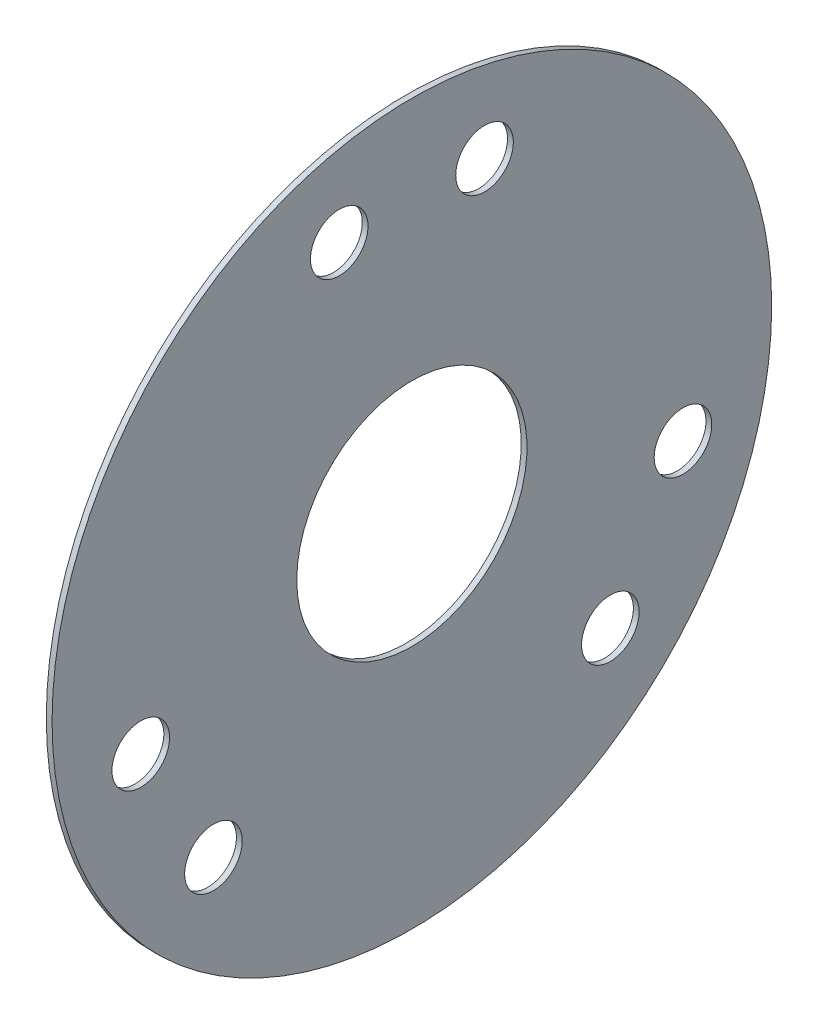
ISO-10303-21;
HEADER;
FILE_DESCRIPTION(('STEP AP214'),'2;1');
FILE_NAME('part.step','',(''),(''),'','','');
FILE_SCHEMA(('AUTOMOTIVE_DESIGN { 1 0 10303 214 1 1 1 1 }'));
ENDSEC;
DATA;
#1=APPLICATION_CONTEXT('core data for automotive mechanical design processes');
#2=APPLICATION_PROTOCOL_DEFINITION('international standard','automotive_design',2000,#1);
#3=PRODUCT_CONTEXT('',#1,'mechanical');
#4=PRODUCT('Part','Part','',(#3));
#5=PRODUCT_RELATED_PRODUCT_CATEGORY('part','',(#4));
#6=PRODUCT_DEFINITION_FORMATION('','',#4);
#7=PRODUCT_DEFINITION_CONTEXT('part definition',#1,'design');
#8=PRODUCT_DEFINITION('design','',#6,#7);
#9=PRODUCT_DEFINITION_SHAPE('','',#8);
#10=(LENGTH_UNIT() NAMED_UNIT(*) SI_UNIT(.MILLI.,.METRE.));
#11=(NAMED_UNIT(*) PLANE_ANGLE_UNIT() SI_UNIT($,.RADIAN.));
#12=(NAMED_UNIT(*) SI_UNIT($,.STERADIAN.) SOLID_ANGLE_UNIT());
#13=UNCERTAINTY_MEASURE_WITH_UNIT(LENGTH_MEASURE(1.E-05),#10,'distance_accuracy_value','');
#14=(GEOMETRIC_REPRESENTATION_CONTEXT(3) GLOBAL_UNCERTAINTY_ASSIGNED_CONTEXT((#13)) GLOBAL_UNIT_ASSIGNED_CONTEXT((#10,
#11,#12)) REPRESENTATION_CONTEXT('',''));
#15=CARTESIAN_POINT('',(0.,0.,0.));
#16=DIRECTION('',(0.,0.,1.));
#17=DIRECTION('',(1.,0.,0.));
#18=AXIS2_PLACEMENT_3D('',#15,#16,#17);
#19=CARTESIAN_POINT('',(-19.8,15.,15.));
#20=DIRECTION('',(1.,0.,0.));
#21=DIRECTION('',(0.,0.,-1.));
#22=AXIS2_PLACEMENT_3D('',#19,#20,#21);
#23=PLANE('',#22);
#24=CARTESIAN_POINT('',(-19.8,15.,15.));
#25=DIRECTION('',(1.,0.,0.));
#26=DIRECTION('',(0.,0.,-1.));
#27=AXIS2_PLACEMENT_3D('',#24,#25,#26);
#28=CIRCLE('',#27,12.5);
#29=CARTESIAN_POINT('',(-19.8,15.,2.5));
#30=VERTEX_POINT('',#29);
#31=EDGE_CURVE('E47',#30,#30,#28,.F.);
#32=ORIENTED_EDGE('',*,*,#31,.F.);
#33=EDGE_LOOP('',(#32));
#34=FACE_BOUND('',#33,.T.);
#35=CARTESIAN_POINT('',(-19.8,15.,15.));
#36=DIRECTION('',(-1.,0.,0.));
#37=DIRECTION('',(0.,0.,1.));
#38=AXIS2_PLACEMENT_3D('',#35,#36,#37);
#39=CIRCLE('',#38,4.);
#40=CARTESIAN_POINT('',(-19.8,15.,19.));
#41=VERTEX_POINT('',#40);
#42=EDGE_CURVE('E50',#41,#41,#39,.T.);
#43=ORIENTED_EDGE('',*,*,#42,.T.);
#44=EDGE_LOOP('',(#43));
#45=FACE_BOUND('',#44,.T.);
#46=CARTESIAN_POINT('',(-19.8,12.4765143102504,5.58222319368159));
#47=DIRECTION('',(-1.,0.,0.));
#48=DIRECTION('',(0.,0.,1.));
#49=AXIS2_PLACEMENT_3D('',#46,#47,#48);
#50=CIRCLE('',#49,1.);
#51=CARTESIAN_POINT('',(-19.8,12.4765143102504,6.58222319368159));
#52=VERTEX_POINT('',#51);
#53=EDGE_CURVE('E53',#52,#52,#50,.T.);
#54=ORIENTED_EDGE('',*,*,#53,.T.);
#55=EDGE_LOOP('',(#54));
#56=FACE_BOUND('',#55,.T.);
#57=CARTESIAN_POINT('',(-19.8,8.10570888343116,8.10570888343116));
#58=DIRECTION('',(-1.,0.,0.));
#59=DIRECTION('',(0.,0.,1.));
#60=AXIS2_PLACEMENT_3D('',#57,#58,#59);
#61=CIRCLE('',#60,1.);
#62=CARTESIAN_POINT('',(-19.8,8.10570888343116,9.10570888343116));
#63=VERTEX_POINT('',#62);
#64=EDGE_CURVE('E56',#63,#63,#61,.T.);
#65=ORIENTED_EDGE('',*,*,#64,.T.);
#66=EDGE_LOOP('',(#65));
#67=FACE_BOUND('',#66,.T.);
#68=CARTESIAN_POINT('',(-19.8,24.4177768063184,17.5234856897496));
#69=DIRECTION('',(-1.,0.,0.));
#70=DIRECTION('',(0.,0.,1.));
#71=AXIS2_PLACEMENT_3D('',#68,#69,#70);
#72=CIRCLE('',#71,1.);
#73=CARTESIAN_POINT('',(-19.8,24.4177768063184,18.5234856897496));
#74=VERTEX_POINT('',#73);
#75=EDGE_CURVE('E59',#74,#74,#72,.T.);
#76=ORIENTED_EDGE('',*,*,#75,.T.);
#77=EDGE_LOOP('',(#76));
#78=FACE_BOUND('',#77,.T.);
#79=CARTESIAN_POINT('',(-19.8,8.10570888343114,21.8942911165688));
#80=DIRECTION('',(-1.,0.,0.));
#81=DIRECTION('',(0.,0.,1.));
#82=AXIS2_PLACEMENT_3D('',#79,#80,#81);
#83=CIRCLE('',#82,1.);
#84=CARTESIAN_POINT('',(-19.8,8.10570888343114,22.8942911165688));
#85=VERTEX_POINT('',#84);
#86=EDGE_CURVE('E62',#85,#85,#83,.T.);
#87=ORIENTED_EDGE('',*,*,#86,.T.);
#88=EDGE_LOOP('',(#87));
#89=FACE_BOUND('',#88,.T.);
#90=CARTESIAN_POINT('',(-19.8,24.4177768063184,12.4765143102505));
#91=DIRECTION('',(-1.,0.,0.));
#92=DIRECTION('',(0.,0.,1.));
#93=AXIS2_PLACEMENT_3D('',#90,#91,#92);
#94=CIRCLE('',#93,1.);
#95=CARTESIAN_POINT('',(-19.8,24.4177768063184,13.4765143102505));
#96=VERTEX_POINT('',#95);
#97=EDGE_CURVE('E64',#96,#96,#94,.T.);
#98=ORIENTED_EDGE('',*,*,#97,.T.);
#99=EDGE_LOOP('',(#98));
#100=FACE_BOUND('',#99,.T.);
#101=CARTESIAN_POINT('',(-19.8,12.4765143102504,24.4177768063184));
#102=DIRECTION('',(-1.,0.,0.));
#103=DIRECTION('',(0.,0.,1.));
#104=AXIS2_PLACEMENT_3D('',#101,#102,#103);
#105=CIRCLE('',#104,1.);
#106=CARTESIAN_POINT('',(-19.8,12.4765143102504,25.4177768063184));
#107=VERTEX_POINT('',#106);
#108=EDGE_CURVE('E18',#107,#107,#105,.T.);
#109=ORIENTED_EDGE('',*,*,#108,.T.);
#110=EDGE_LOOP('',(#109));
#111=FACE_BOUND('',#110,.T.);
#112=ADVANCED_FACE('F15',(#34,#45,#56,#67,#78,#89,#100,#111),#23,.T.);
#113=CARTESIAN_POINT('',(-19.8,12.4765143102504,24.4177768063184));
#114=DIRECTION('',(-1.,0.,0.));
#115=DIRECTION('',(0.,0.,1.));
#116=AXIS2_PLACEMENT_3D('',#113,#114,#115);
#117=CYLINDRICAL_SURFACE('',#116,1.);
#118=ORIENTED_EDGE('',*,*,#108,.F.);
#119=EDGE_LOOP('',(#118));
#120=FACE_BOUND('',#119,.T.);
#121=CARTESIAN_POINT('',(-20.,12.4765143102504,24.4177768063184));
#122=DIRECTION('',(-1.,0.,0.));
#123=DIRECTION('',(0.,0.,1.));
#124=AXIS2_PLACEMENT_3D('',#121,#122,#123);
#125=CIRCLE('',#124,1.);
#126=CARTESIAN_POINT('',(-20.,12.4765143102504,25.4177768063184));
#127=VERTEX_POINT('',#126);
#128=EDGE_CURVE('E44',#127,#127,#125,.F.);
#129=ORIENTED_EDGE('',*,*,#128,.F.);
#130=EDGE_LOOP('',(#129));
#131=FACE_BOUND('',#130,.T.);
#132=ADVANCED_FACE('F72',(#120,#131),#117,.F.);
#133=CARTESIAN_POINT('',(-19.8,24.4177768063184,12.4765143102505));
#134=DIRECTION('',(-1.,0.,0.));
#135=DIRECTION('',(0.,0.,1.));
#136=AXIS2_PLACEMENT_3D('',#133,#134,#135);
#137=CYLINDRICAL_SURFACE('',#136,1.);
#138=ORIENTED_EDGE('',*,*,#97,.F.);
#139=EDGE_LOOP('',(#138));
#140=FACE_BOUND('',#139,.T.);
#141=CARTESIAN_POINT('',(-20.,24.4177768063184,12.4765143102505));
#142=DIRECTION('',(-1.,0.,0.));
#143=DIRECTION('',(0.,0.,1.));
#144=AXIS2_PLACEMENT_3D('',#141,#142,#143);
#145=CIRCLE('',#144,1.);
#146=CARTESIAN_POINT('',(-20.,24.4177768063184,13.4765143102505));
#147=VERTEX_POINT('',#146);
#148=EDGE_CURVE('E41',#147,#147,#145,.F.);
#149=ORIENTED_EDGE('',*,*,#148,.F.);
#150=EDGE_LOOP('',(#149));
#151=FACE_BOUND('',#150,.T.);
#152=ADVANCED_FACE('F75',(#140,#151),#137,.F.);
#153=CARTESIAN_POINT('',(-19.8,8.10570888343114,21.8942911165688));
#154=DIRECTION('',(-1.,0.,0.));
#155=DIRECTION('',(0.,0.,1.));
#156=AXIS2_PLACEMENT_3D('',#153,#154,#155);
#157=CYLINDRICAL_SURFACE('',#156,1.);
#158=ORIENTED_EDGE('',*,*,#86,.F.);
#159=EDGE_LOOP('',(#158));
#160=FACE_BOUND('',#159,.T.);
#161=CARTESIAN_POINT('',(-20.,8.10570888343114,21.8942911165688));
#162=DIRECTION('',(-1.,0.,0.));
#163=DIRECTION('',(0.,0.,1.));
#164=AXIS2_PLACEMENT_3D('',#161,#162,#163);
#165=CIRCLE('',#164,1.);
#166=CARTESIAN_POINT('',(-20.,8.10570888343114,22.8942911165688));
#167=VERTEX_POINT('',#166);
#168=EDGE_CURVE('E38',#167,#167,#165,.F.);
#169=ORIENTED_EDGE('',*,*,#168,.F.);
#170=EDGE_LOOP('',(#169));
#171=FACE_BOUND('',#170,.T.);
#172=ADVANCED_FACE('F105',(#160,#171),#157,.F.);
#173=CARTESIAN_POINT('',(-19.8,24.4177768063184,17.5234856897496));
#174=DIRECTION('',(-1.,0.,0.));
#175=DIRECTION('',(0.,0.,1.));
#176=AXIS2_PLACEMENT_3D('',#173,#174,#175);
#177=CYLINDRICAL_SURFACE('',#176,1.);
#178=ORIENTED_EDGE('',*,*,#75,.F.);
#179=EDGE_LOOP('',(#178));
#180=FACE_BOUND('',#179,.T.);
#181=CARTESIAN_POINT('',(-20.,24.4177768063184,17.5234856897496));
#182=DIRECTION('',(-1.,0.,0.));
#183=DIRECTION('',(0.,0.,1.));
#184=AXIS2_PLACEMENT_3D('',#181,#182,#183);
#185=CIRCLE('',#184,1.);
#186=CARTESIAN_POINT('',(-20.,24.4177768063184,18.5234856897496));
#187=VERTEX_POINT('',#186);
#188=EDGE_CURVE('E35',#187,#187,#185,.F.);
#189=ORIENTED_EDGE('',*,*,#188,.F.);
#190=EDGE_LOOP('',(#189));
#191=FACE_BOUND('',#190,.T.);
#192=ADVANCED_FACE('F101',(#180,#191),#177,.F.);
#193=CARTESIAN_POINT('',(-19.8,8.10570888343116,8.10570888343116));
#194=DIRECTION('',(-1.,0.,0.));
#195=DIRECTION('',(0.,0.,1.));
#196=AXIS2_PLACEMENT_3D('',#193,#194,#195);
#197=CYLINDRICAL_SURFACE('',#196,1.);
#198=ORIENTED_EDGE('',*,*,#64,.F.);
#199=EDGE_LOOP('',(#198));
#200=FACE_BOUND('',#199,.T.);
#201=CARTESIAN_POINT('',(-20.,8.10570888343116,8.10570888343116));
#202=DIRECTION('',(-1.,0.,0.));
#203=DIRECTION('',(0.,0.,1.));
#204=AXIS2_PLACEMENT_3D('',#201,#202,#203);
#205=CIRCLE('',#204,1.);
#206=CARTESIAN_POINT('',(-20.,8.10570888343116,9.10570888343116));
#207=VERTEX_POINT('',#206);
#208=EDGE_CURVE('E32',#207,#207,#205,.F.);
#209=ORIENTED_EDGE('',*,*,#208,.F.);
#210=EDGE_LOOP('',(#209));
#211=FACE_BOUND('',#210,.T.);
#212=ADVANCED_FACE('F97',(#200,#211),#197,.F.);
#213=CARTESIAN_POINT('',(-19.8,12.4765143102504,5.58222319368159));
#214=DIRECTION('',(-1.,0.,0.));
#215=DIRECTION('',(0.,0.,1.));
#216=AXIS2_PLACEMENT_3D('',#213,#214,#215);
#217=CYLINDRICAL_SURFACE('',#216,1.);
#218=ORIENTED_EDGE('',*,*,#53,.F.);
#219=EDGE_LOOP('',(#218));
#220=FACE_BOUND('',#219,.T.);
#221=CARTESIAN_POINT('',(-20.,12.4765143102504,5.58222319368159));
#222=DIRECTION('',(-1.,0.,0.));
#223=DIRECTION('',(0.,0.,1.));
#224=AXIS2_PLACEMENT_3D('',#221,#222,#223);
#225=CIRCLE('',#224,1.);
#226=CARTESIAN_POINT('',(-20.,12.4765143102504,6.58222319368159));
#227=VERTEX_POINT('',#226);
#228=EDGE_CURVE('E27',#227,#227,#225,.F.);
#229=ORIENTED_EDGE('',*,*,#228,.F.);
#230=EDGE_LOOP('',(#229));
#231=FACE_BOUND('',#230,.T.);
#232=ADVANCED_FACE('F93',(#220,#231),#217,.F.);
#233=CARTESIAN_POINT('',(-19.8,15.,15.));
#234=DIRECTION('',(-1.,0.,0.));
#235=DIRECTION('',(0.,0.,1.));
#236=AXIS2_PLACEMENT_3D('',#233,#234,#235);
#237=CYLINDRICAL_SURFACE('',#236,4.);
#238=ORIENTED_EDGE('',*,*,#42,.F.);
#239=EDGE_LOOP('',(#238));
#240=FACE_BOUND('',#239,.T.);
#241=CARTESIAN_POINT('',(-20.,15.,15.));
#242=DIRECTION('',(-1.,0.,0.));
#243=DIRECTION('',(0.,0.,1.));
#244=AXIS2_PLACEMENT_3D('',#241,#242,#243);
#245=CIRCLE('',#244,4.);
#246=CARTESIAN_POINT('',(-20.,15.,19.));
#247=VERTEX_POINT('',#246);
#248=EDGE_CURVE('E22',#247,#247,#245,.F.);
#249=ORIENTED_EDGE('',*,*,#248,.F.);
#250=EDGE_LOOP('',(#249));
#251=FACE_BOUND('',#250,.T.);
#252=ADVANCED_FACE('F86',(#240,#251),#237,.F.);
#253=CARTESIAN_POINT('',(-20.,15.,15.));
#254=DIRECTION('',(1.,0.,0.));
#255=DIRECTION('',(0.,0.,-1.));
#256=AXIS2_PLACEMENT_3D('',#253,#254,#255);
#257=CYLINDRICAL_SURFACE('',#256,12.5);
#258=CARTESIAN_POINT('',(-20.,15.,15.));
#259=DIRECTION('',(1.,0.,0.));
#260=DIRECTION('',(0.,0.,-1.));
#261=AXIS2_PLACEMENT_3D('',#258,#259,#260);
#262=CIRCLE('',#261,12.5);
#263=CARTESIAN_POINT('',(-20.,15.,2.5));
#264=VERTEX_POINT('',#263);
#265=EDGE_CURVE('E10',#264,#264,#262,.F.);
#266=ORIENTED_EDGE('',*,*,#265,.F.);
#267=EDGE_LOOP('',(#266));
#268=FACE_BOUND('',#267,.T.);
#269=ORIENTED_EDGE('',*,*,#31,.T.);
#270=EDGE_LOOP('',(#269));
#271=FACE_BOUND('',#270,.T.);
#272=ADVANCED_FACE('F80',(#268,#271),#257,.T.);
#273=CARTESIAN_POINT('',(-20.,15.,15.));
#274=DIRECTION('',(-1.,0.,0.));
#275=DIRECTION('',(0.,0.,1.));
#276=AXIS2_PLACEMENT_3D('',#273,#274,#275);
#277=PLANE('',#276);
#278=ORIENTED_EDGE('',*,*,#265,.T.);
#279=EDGE_LOOP('',(#278));
#280=FACE_BOUND('',#279,.T.);
#281=ORIENTED_EDGE('',*,*,#248,.T.);
#282=EDGE_LOOP('',(#281));
#283=FACE_BOUND('',#282,.T.);
#284=ORIENTED_EDGE('',*,*,#228,.T.);
#285=EDGE_LOOP('',(#284));
#286=FACE_BOUND('',#285,.T.);
#287=ORIENTED_EDGE('',*,*,#208,.T.);
#288=EDGE_LOOP('',(#287));
#289=FACE_BOUND('',#288,.T.);
#290=ORIENTED_EDGE('',*,*,#188,.T.);
#291=EDGE_LOOP('',(#290));
#292=FACE_BOUND('',#291,.T.);
#293=ORIENTED_EDGE('',*,*,#168,.T.);
#294=EDGE_LOOP('',(#293));
#295=FACE_BOUND('',#294,.T.);
#296=ORIENTED_EDGE('',*,*,#148,.T.);
#297=EDGE_LOOP('',(#296));
#298=FACE_BOUND('',#297,.T.);
#299=ORIENTED_EDGE('',*,*,#128,.T.);
#300=EDGE_LOOP('',(#299));
#301=FACE_BOUND('',#300,.T.);
#302=ADVANCED_FACE('F78',(#280,#283,#286,#289,#292,#295,#298,#301),#277,.T.);
#303=CLOSED_SHELL('',(#112,#132,#152,#172,#192,#212,#232,#252,#272,#302));
#304=MANIFOLD_SOLID_BREP('B1',#303);
#305=ADVANCED_BREP_SHAPE_REPRESENTATION('',(#18,#304),#14);
#306=SHAPE_DEFINITION_REPRESENTATION(#9,#305);
ENDSEC;
END-ISO-10303-21;
